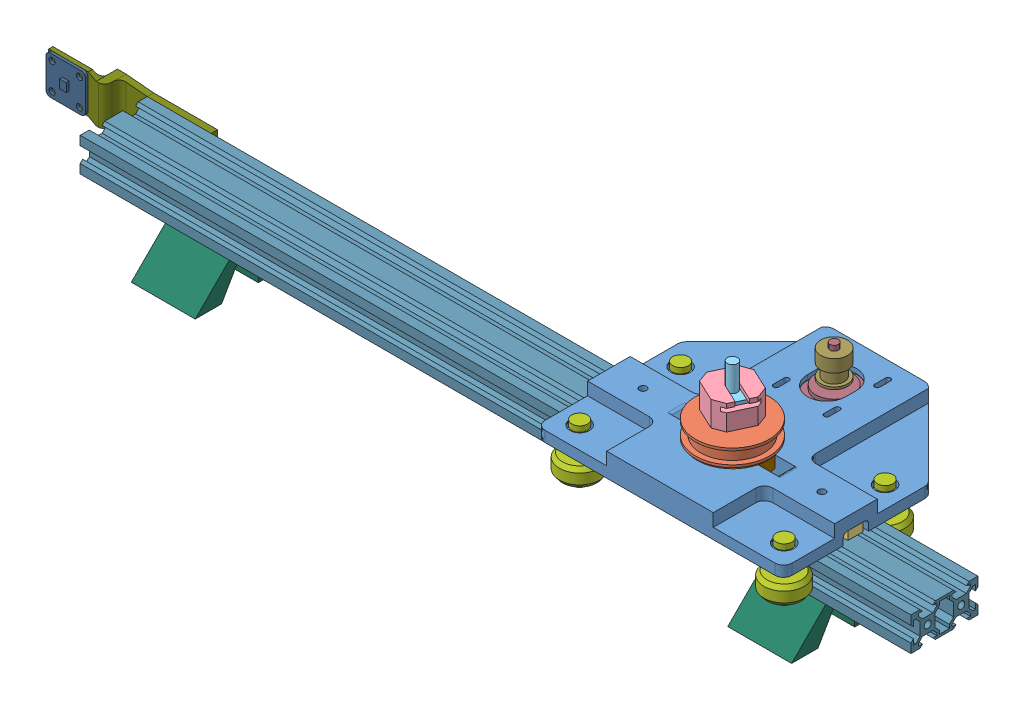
SolidWorks assembly Total Assembly.SLDASM, configuration Default (file format 15000). Lengths in mm.
Overall size (545.21 98.42 134.95).
24 component instances, 16 part files, 12 mates.
Components (placement in the parent):
- Camera Mount Assembly-1: Camera Mount Assembly.SLDASM [Default] at (442.5309 13.081 -43.18) x (-1 0 0) z (0 0 -1) size (155.86 84.23 134.95)
  - Camera Adapter w Bearings-1: Camera Adapter w Bearings.SLDPRT [Default] at origin size (147.32 13.97 130.81)
  - Big Pully-1: Big Pully.SLDPRT [Default] at (73.66 25.4 -43.18) x (-0.462019 0 -0.88687) z (-0.88687 0 0.462019) size (43.94 16.13 43.94)
  - Timing Belt Holder-1: Timing Belt Holder.SLDPRT [Default] at (20.32 6.35 -43.18) x (1 0 0) z (0 0 -1) size (40 5.33 9.04)
  - Timing Belt Holder-2: Timing Belt Holder.SLDPRT [Default] at (127 6.35 -43.18) x (1 0 0) z (0 0 -1) size (40 5.33 9.04)
  - Camera to Shaft Adapter-1: Camera to Shaft Adapter.SLDPRT [Glue] at (73.66 40.108 -43.18) x (0.422131 0 -0.906535) z (-0.906535 0 -0.422131) size (24.38 14.73 24.38)
  - Camera Screw-1: Camera Screw.SLDPRT [Default] at (73.66 38.203 -43.18) x (-0.422131 0 0.906535) z (-0.906535 0 -0.422131) size (18.03 16.81 18.03)
  - Shaft-1: Shaft.SLDPRT [Default] at (73.66 38.203 -43.18) x (0.883617 0 -0.468211) z (-0.468211 0 -0.883617) size (7.95 30.48 7.95)
  - Bearings-1: Bearings.SLDPRT [Default] at (134.62 9.1948 -13.1064) x (0.724268 0 0.689518) z (-0.689518 0 0.724268) size (24 32.44 24)
  - Bearings-2: Bearings.SLDPRT [Default] at (12.7 9.1948 -13.1064) x (0.724268 0 0.689518) z (-0.689518 0 0.724268) size (24 32.44 24)
  - Bearings-3: Bearings.SLDPRT [Default] at (134.62 9.1948 -73.3044) x (0.724268 0 0.689518) z (-0.689518 0 0.724268) size (24 32.44 24)
  - Bearings-4: Bearings.SLDPRT [Default] at (12.7 9.1948 -73.3044) x (0.724268 0 0.689518) z (-0.689518 0 0.724268) size (24 32.44 24)
  - Big Pully Adapter-1: Big Pully Adapter.SLDPRT [Default] at (73.66 7.366 -43.18) x (-0.046219 0 -0.998931) z (0.998931 0 -0.046219) size (33.02 7.87 33.02)
  - Shaft Bearing-1: Shaft Bearing.SLDPRT [Default] at (73.66 10.4775 -43.18) x (0.99903 0 -0.044037) z (0.044037 0 0.99903) size (42.01 6.99 42.01)
  - Encoder Chip-1: Encoder Chip.SLDPRT [Default] at (73.66 1.905 -43.18) x (-1 0 0) z (0 0 -1) size (23.49 3.3 22.86)
  - Magnet-1: Magnet.SLDPRT [Default] at (73.66 6.707 -43.18) x (0.998847 0 -0.048009) z (0.048009 0 0.998847) size (3.99 1.02 3.99)
  - Small Pully-1: Small Pully.SLDPRT [Default] at (73.66 31.3055 17.5037) x (0.522691 0 0.852522) z (0 1 0) size (16 16 16)
  - Stepper Motor-1: Stepper Motor.SLDPRT [Default] at (73.66 -29.21 17.5037) size (42.16 63.5 48.26)
- Feet Assembly-1: Feet Assembly.SLDASM [Default] at origin size (495.3 40.32 80.64)
  - 2040 Extrusion-1: 2040 Extrusion.SLDPRT [Default] at origin size (495.3 20 40)
  - Feet-1: Feet.SLDPRT [Default] at (406.4 -11.905 0) size (38.1 20.32 80.64)
  - Feet-2: Feet.SLDPRT [Default] at (50.8 -11.905 0) size (38.1 20.32 80.64)
- Rotary Encoder Mount-1: Rotary Encoder Mount.SLDPRT [Default] at (38.1 10 -21.905) x (-1 0 0) z (0 1 0) size (88.01 12.7 25.53)
- Encoder Chip-1: Encoder Chip.SLDPRT [Default] at (-38.1478 2.5908 -11.11) x (1 0 0) z (0 -1 0) size (23.49 3.3 22.86)
Mates (geometry in assembly coordinates):
- Coincident1: coincident aligned: plane of Feet Assembly-1 through (0 0 0) normal (0 0 1)
- Coincident2: coincident aligned: plane of Feet Assembly-1 through (0 0 0) normal (0 1 0)
- Coincident3: coincident aligned: plane of Feet Assembly-1 through (0 0 0) normal (1 0 0)
- Width1: width anti-aligned: plane of Camera Mount Assembly-1/Timing Belt Holder-2 through (335.5334 14.097 4.5212) normal (0 0 1); plane of Camera Mount Assembly-1/Timing Belt Holder-2 through (335.5334 14.097 -4.5212) normal (0 0 -1); plane of Feet Assembly-1/2040 Extrusion-1 through (495.3 0 -20) normal (0 0 -1); plane of Feet Assembly-1/2040 Extrusion-1 through (495.3 0 20) normal (0 0 1)
- Width2: width aligned: plane of Camera Mount Assembly-1/Bearings-1 through (304.4607 5.461 -26.4495) normal (0 1 0); plane of Camera Mount Assembly-1/Bearings-1 through (300.9054 -5.461 -22.715) normal (0 -1 0); plane of Feet Assembly-1/2040 Extrusion-1 through (495.3 10 0) normal (0 1 0); plane of Feet Assembly-1/2040 Extrusion-1 through (495.3 -10 0) normal (0 -1 0)
- Coincident4: coincident anti-aligned: plane of Feet Assembly-1/2040 Extrusion-1 through (495.3 0 -20) normal (0 0 -1); plane of Rotary Encoder Mount-1 through (0 10 -20) normal (0 0 1)
- Parallel1: parallel aligned: plane of Feet Assembly-1/2040 Extrusion-1 through (0 0 0) normal (-1 0 0); plane of Rotary Encoder Mount-1 through (-49.911 14.0335 -13.65) normal (-1 0 0)
- Width3: width anti-aligned: plane of Feet Assembly-1/2040 Extrusion-1 through (495.3 10 0) normal (0 1 0); plane of Feet Assembly-1/2040 Extrusion-1 through (495.3 -10 0) normal (0 -1 0); plane of Rotary Encoder Mount-1 through (0 -10 -20) normal (0 -1 0); plane of Rotary Encoder Mount-1 through (0 10 -20) normal (0 1 0)
- Coincident5: coincident anti-aligned: line of Feet Assembly-1/2040 Extrusion-1 through (0 10 -20) axis (0 0 1); line of Rotary Encoder Mount-1 through (0 10 -20) axis (0 0 -1)
- Coincident6: coincident anti-aligned: plane of Rotary Encoder Mount-1 through (38.1 10 -11.11) normal (0 0 1); plane of Encoder Chip-1 through (-38.1478 2.5908 -11.11) normal (0 0 -1)
- Concentric1: concentric aligned: cylinder of Rotary Encoder Mount-1 through (-29.9563 10.4648 -13.65) axis (0 0 1) radius 1.7907; cylinder of Encoder Chip-1 through (-29.9563 10.4648 -11.11) axis (0 0 1) radius 1.778
- Parallel2: parallel aligned: cylinder of Rotary Encoder Mount-1 through (-46.2437 -5.3848 -13.65) axis (0 0 1) radius 1.7907; cylinder of Encoder Chip-1 through (-46.3393 -5.2832 -11.11) axis (0 0 1) radius 1.778
